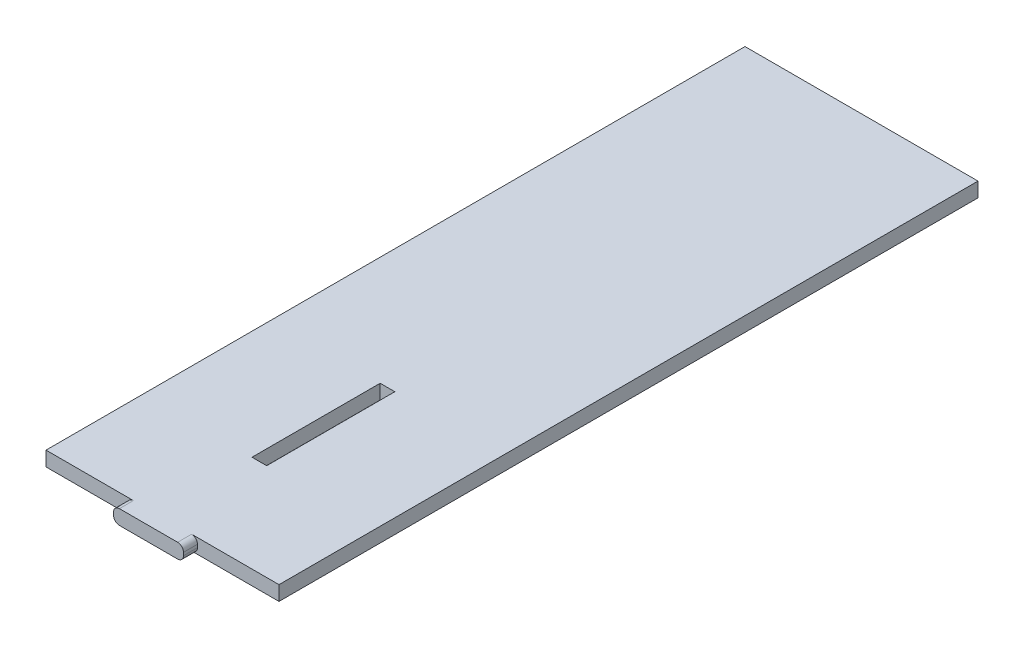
from build123d import *

# Parameters (mm, degrees)
SKETCH1_W           = 200
SKETCH1_H           = 600
BOSS_EXTRUDE1_DEPTH = 12.5
BOSS_EXTRUDE2_DEPTH = 12
SKETCH4_W           = 12.6
SKETCH4_H           = 110
CUT_EXTRUDE2_DEPTH  = 12.5


with BuildPart() as part:
    # Sketch1 → Boss-Extrude1 (new body)
    with BuildSketch(Plane(origin=(0, 0, 0), x_dir=(1, 0, 0), z_dir=(0, 1, 0))):
        with Locations((-18.557767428, -50)):
            Rectangle(SKETCH1_W, SKETCH1_H)
    extrude(amount=BOSS_EXTRUDE1_DEPTH)

    # Sketch3 → Boss-Extrude2 (add)
    with BuildSketch(Plane.XY.offset(350)):
        with BuildLine():
            Line((-43.557767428, 12.5), (6.442232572, 12.5))
            ThreePointArc((6.442232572, 12.5), (9.977766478, 11.035533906), (11.442232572, 7.5))
            Line((11.442232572, 7.5), (11.442232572, 5))
            ThreePointArc((11.442232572, 5), (9.977766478, 1.464466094), (6.442232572, 0))
            Line((6.442232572, 0), (-43.557767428, 0))
            ThreePointArc((-43.557767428, 0), (-47.093301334, 1.464466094), (-48.557767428, 5))
            Line((-48.557767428, 5), (-48.557767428, 7.5))
            ThreePointArc((-48.557767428, 7.5), (-47.093301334, 11.035533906), (-43.557767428, 12.5))
        make_face()
    extrude(amount=BOSS_EXTRUDE2_DEPTH)

    # Sketch4 → Cut-Extrude2 (cut)
    with BuildSketch(Plane.XZ):
        with Locations((-18.557767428, 211.87999242)):
            Rectangle(SKETCH4_W, SKETCH4_H)
    extrude(amount=-CUT_EXTRUDE2_DEPTH, mode=Mode.SUBTRACT)


solid = part.part
